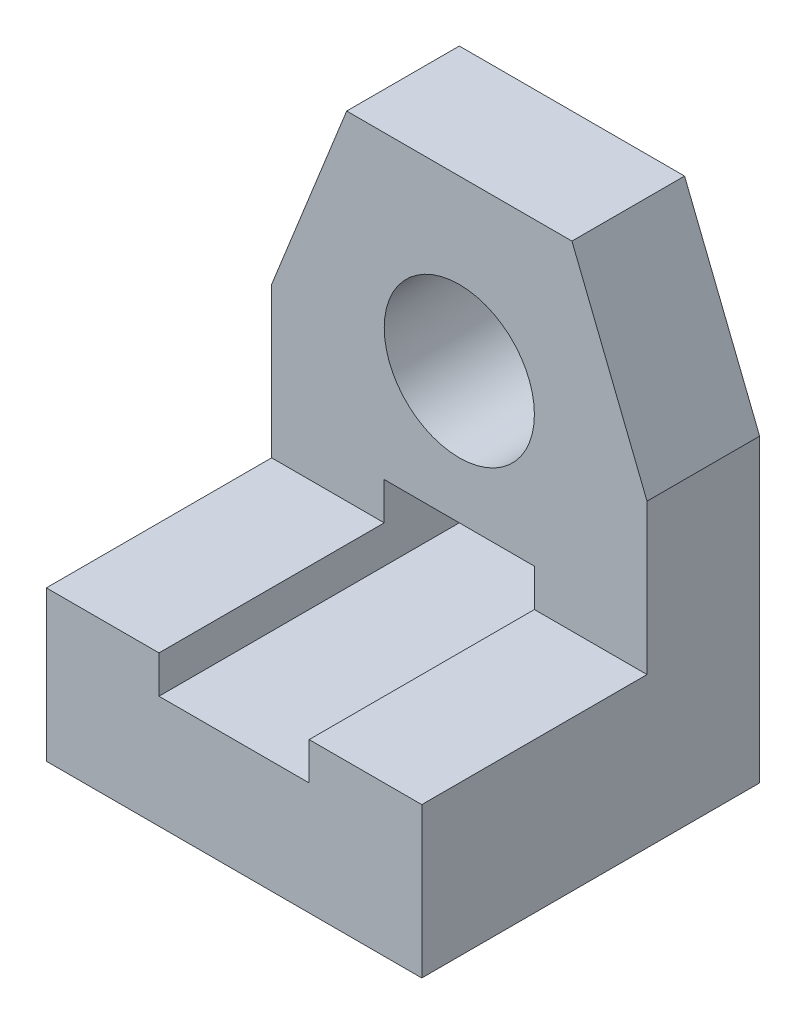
from build123d import *

# Parameters (mm, degrees)
SKETCH_1_W          = 50
SKETCH_1_H          = 45
EXTRUDE_1_DEPTH     = 20
SKETCH_2_R          = 10
EXTRUDE_2_DEPTH     = 15
SKETCH_3_W          = 20
SKETCH_3_H          = 10
CUT_EXTRUDE_1_DEPTH = 94.541434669


with BuildPart() as part:
    # Sketch 1 → Extrude 1 (new body)
    with BuildSketch(Plane(origin=(0, 0, 0), x_dir=(1, 0, 0), z_dir=(0, 1, 0))):
        with Locations((25, 22.5)):
            Rectangle(SKETCH_1_W, SKETCH_1_H)
    extrude(amount=EXTRUDE_1_DEPTH)

    # Sketch 2 → Extrude 2 (add)
    with BuildSketch(Plane(origin=(0, 0, -45), x_dir=(-1, 0, 0), z_dir=(0, 0, -1))):
        Polygon((-50, 20), (-50, 40), (-40, 65), (-10, 65), (0, 40), (0, 20), align=None)
        with Locations((-25, 42.5)):
            Circle(SKETCH_2_R, mode=Mode.SUBTRACT)
    extrude(amount=-EXTRUDE_2_DEPTH)

    # Sketch 3 → Cut-Extrude 1 (cut, through all)
    with BuildSketch(Plane.XY):
        with Locations((25, 20)):
            Rectangle(SKETCH_3_W, SKETCH_3_H)
    extrude(amount=-CUT_EXTRUDE_1_DEPTH, mode=Mode.SUBTRACT)


solid = part.part
